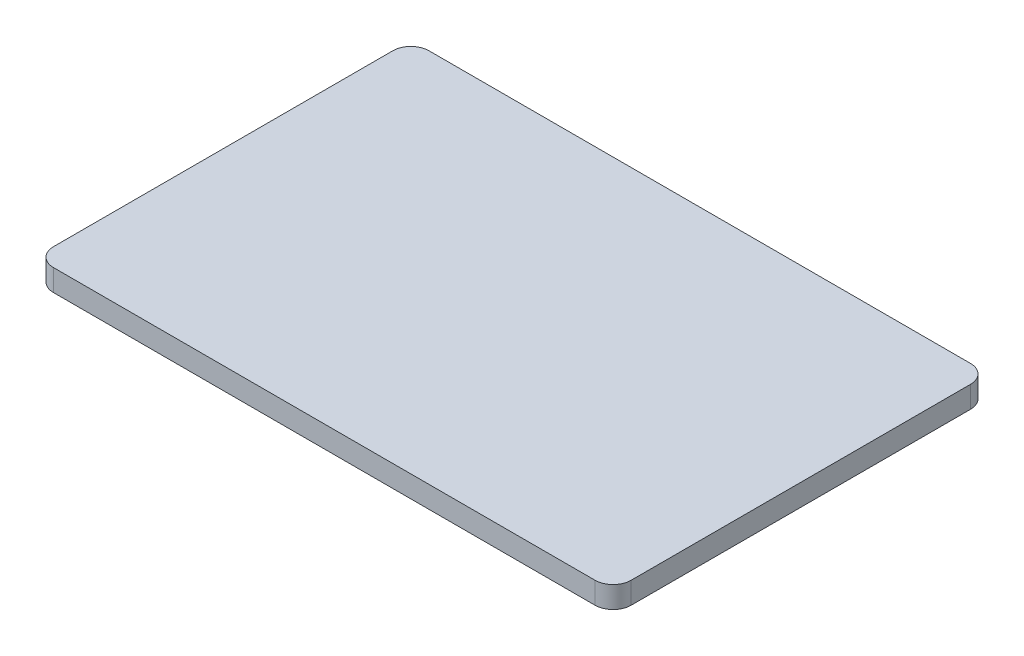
from build123d import *

# Parameters (mm, degrees)
BOSS_EXTRUDE1_DEPTH = 3


with BuildPart() as part:
    # Sketch1 → Boss-Extrude1 (new body)
    with BuildSketch(Plane(origin=(0, 0, 0), x_dir=(1, 0, 0), z_dir=(0, 1, 0))):
        with BuildLine():
            Line((-37.5, -26), (37.5, -26))
            ThreePointArc((37.5, -26), (39.267766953, -25.267766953), (40, -23.5))
            Line((40, -23.5), (40, 23.5))
            ThreePointArc((40, 23.5), (39.267766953, 25.267766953), (37.5, 26))
            Line((37.5, 26), (-37.5, 26))
            ThreePointArc((-37.5, 26), (-39.267766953, 25.267766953), (-40, 23.5))
            Line((-40, 23.5), (-40, -23.5))
            ThreePointArc((-40, -23.5), (-39.267766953, -25.267766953), (-37.5, -26))
        make_face()
    extrude(amount=BOSS_EXTRUDE1_DEPTH)


solid = part.part
